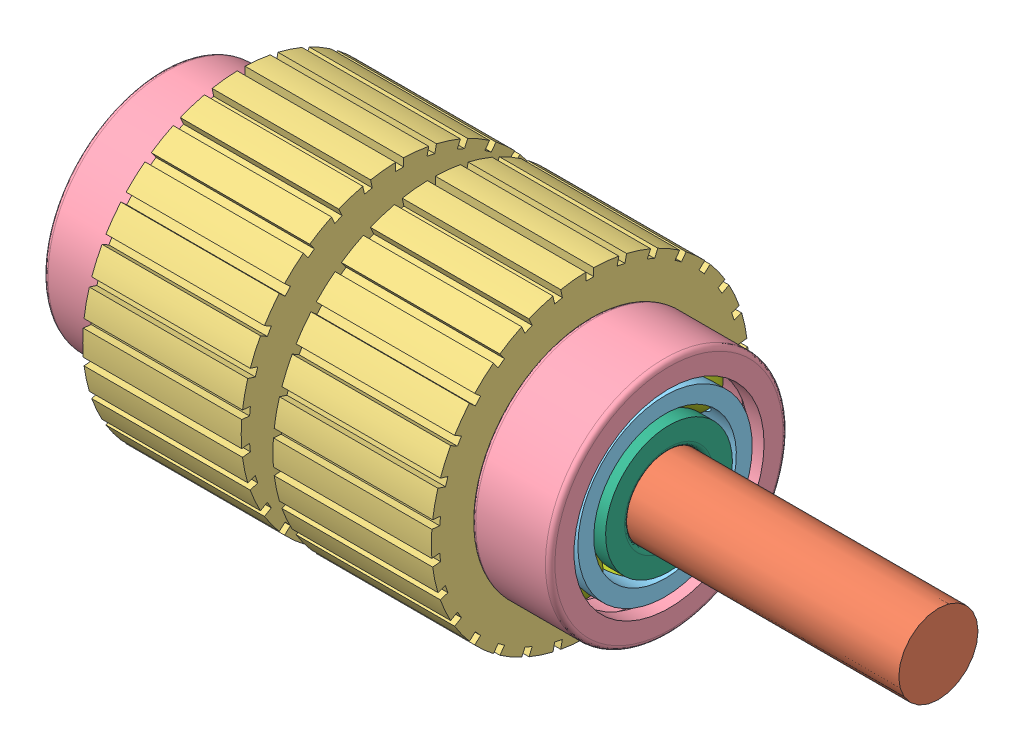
SolidWorks assembly shaft_assem.SLDASM, configuration Default (file format 8000). Lengths in mm.
Overall size (51 20.91 20.91).
29 component instances, 8 part files, 14 mates.
Components (placement in the parent):
- key-1: key.SLDPRT [Default] at (0 2.2913 0) size (22 2 2)
- shaft-1: shaft.SLDPRT [Default] at origin size (51 5 5)
- gear-1: gear.SLDPRT [Default] at (-6 0 0) size (10 19.99 20)
- gear-3: gear.SLDPRT [Default] at (6 0 0) size (10 19.99 20)
- bearing-1: bearing.SLDASM [Default] at (13.5 0 0) x (1 0 0) z (0 0.578559 0.81564) size (5 15 15)
  - bearing_outer-1: bearing_outer.SLDPRT [Default] at origin size (5 15 15)
  - bearing_mid-1: bearing_mid.SLDPRT [Default] x (1 0 0) z (0 -0.240835 -0.970566) size (4.5 11 11)
  - bearing_inner-1: bearing_inner.SLDPRT [Default] x (1 0 0) z (0 -0.933156 -0.359471) size (5 8 8)
  - ball_bearing-1: ball_bearing.SLDPRT [Default] at (0 -4.8528 1.2042) x (1 0 0) z (0 0.240835 0.970566) size (3 3 3)
  - ball_bearing-10: ball_bearing.SLDPRT [Default] at (0 -2.58 4.2829) x (1 0 0) z (0 0.85659 0.515998) size (3 3 3)
  - ball_bearing-11: ball_bearing.SLDPRT [Default] at (0 1.2042 4.8528) x (1 0 0) z (0 0.970566 -0.240835) size (3 3 3)
  - ball_bearing-12: ball_bearing.SLDPRT [Default] at (0 4.2829 2.58) x (1 0 0) z (0 0.515998 -0.85659) size (3 3 3)
  - ball_bearing-13: ball_bearing.SLDPRT [Default] at (0 4.8528 -1.2042) x (1 0 0) z (0 -0.240835 -0.970566) size (3 3 3)
  - ball_bearing-14: ball_bearing.SLDPRT [Default] at (0 2.58 -4.2829) x (1 0 0) z (0 -0.85659 -0.515998) size (3 3 3)
  - ball_bearing-15: ball_bearing.SLDPRT [Default] at (0 -1.2042 -4.8528) x (1 0 0) z (0 -0.970566 0.240835) size (3 3 3)
  - ball_bearing-16: ball_bearing.SLDPRT [Default] at (0 -4.2829 -2.58) x (1 0 0) z (0 -0.515998 0.85659) size (3 3 3)
- bearing-2: bearing.SLDASM [Default] at (-13.5 0 0) x (1 0 0) z (0 -0.212785 -0.977099) size (5 15 15)
  - bearing_outer-1: bearing_outer.SLDPRT [Default] at origin size (5 15 15)
  - bearing_mid-1: bearing_mid.SLDPRT [Default] x (1 0 0) z (0 -0.240835 -0.970566) size (4.5 11 11)
  - bearing_inner-1: bearing_inner.SLDPRT [Default] x (1 0 0) z (0 -0.933156 -0.359471) size (5 8 8)
  - ball_bearing-1: ball_bearing.SLDPRT [Default] at (0 -4.8528 1.2042) x (1 0 0) z (0 0.240835 0.970566) size (3 3 3)
  - ball_bearing-10: ball_bearing.SLDPRT [Default] at (0 -2.58 4.2829) x (1 0 0) z (0 0.85659 0.515998) size (3 3 3)
  - ball_bearing-11: ball_bearing.SLDPRT [Default] at (0 1.2042 4.8528) x (1 0 0) z (0 0.970566 -0.240835) size (3 3 3)
  - ball_bearing-12: ball_bearing.SLDPRT [Default] at (0 4.2829 2.58) x (1 0 0) z (0 0.515998 -0.85659) size (3 3 3)
  - ball_bearing-13: ball_bearing.SLDPRT [Default] at (0 4.8528 -1.2042) x (1 0 0) z (0 -0.240835 -0.970566) size (3 3 3)
  - ball_bearing-14: ball_bearing.SLDPRT [Default] at (0 2.58 -4.2829) x (1 0 0) z (0 -0.85659 -0.515998) size (3 3 3)
  - ball_bearing-15: ball_bearing.SLDPRT [Default] at (0 -1.2042 -4.8528) x (1 0 0) z (0 -0.970566 0.240835) size (3 3 3)
  - ball_bearing-16: ball_bearing.SLDPRT [Default] at (0 -4.2829 -2.58) x (1 0 0) z (0 -0.515998 0.85659) size (3 3 3)
- 2m spacer-1: 2m spacer.SLDPRT [Default] at origin size (2 9 9)
Mates (geometry in assembly coordinates):
- Coincident5: coordinate: point of ?
- Coincident3: coincident aligned: line of shaft-1 through (11 1.2913 1) axis (0 0 -1); line of key-1 through (11 1.2913 1) axis (0 0 -1)
- Coincident4: coincident aligned: line of shaft-1 through (-11 1.2913 -1) axis (1 0 0); line of key-1 through (-11 1.2913 -1) axis (1 0 0)
- Coincident6: coincident anti-aligned: line of key-1 through (-11 3.2913 -1) axis (1 0 0); line of gear-1 through (-1 3.2913 -1) axis (-1 0 0)
- Coincident7: coincident anti-aligned: line of key-1 through (-11 3.2913 -1) axis (0 0 1); line of gear-1 through (-11 3.2913 1) axis (0 0 -1)
- Coincident11: coincident anti-aligned: line of key-1 through (-11 3.2913 -1) axis (1 0 0); line of gear-3 through (11 3.2913 -1) axis (-1 0 0)
- Coincident14: coincident anti-aligned: line of key-1 through (11 3.2913 -1) axis (0 0 1); line of gear-3 through (11 3.2913 1) axis (0 0 -1)
- Concentric1: concentric anti-aligned: cylinder of shaft-1 through (-11 0 0) axis (1 0 0) radius 2.5; cylinder of bearing-1/bearing_inner-1 through (11 0 0) axis (-1 0 0) radius 2.5
- Concentric2: concentric anti-aligned: cylinder of shaft-1 through (-11 0 0) axis (1 0 0) radius 2.5; cylinder of bearing-2/bearing_inner-1 through (-16 0 0) axis (-1 0 0) radius 2.5
- Coincident19: coincident anti-aligned: plane of gear-1 through (-11 0 0) normal (-1 0 0); plane of bearing-2/bearing_inner-1 through (-11 0.3817 -2.4707) normal (1 0 0)
- Coincident15: coincident aligned: line of key-1 through (-11 3.2913 -1) axis (1 0 0); line of 2m spacer-1 through (-1 3.2913 -1) axis (1 0 0)
- Concentric3: concentric anti-aligned: cylinder of shaft-1 through (-11 0 0) axis (1 0 0) radius 2.5; cylinder of 2m spacer-1 through (-1 0 0) axis (-1 0 0) radius 2.5
- Coincident18: coincident anti-aligned: plane of gear-3 through (1 0 0) normal (-1 0 0); plane of 2m spacer-1 through (1 4.5 0) normal (1 0 0)
- Coincident21: coincident anti-aligned: plane of gear-3 through (11 0 0) normal (1 0 0); plane of bearing-1/bearing_outer-1 through (11 6.1173 -4.3392) normal (-1 0 0)
